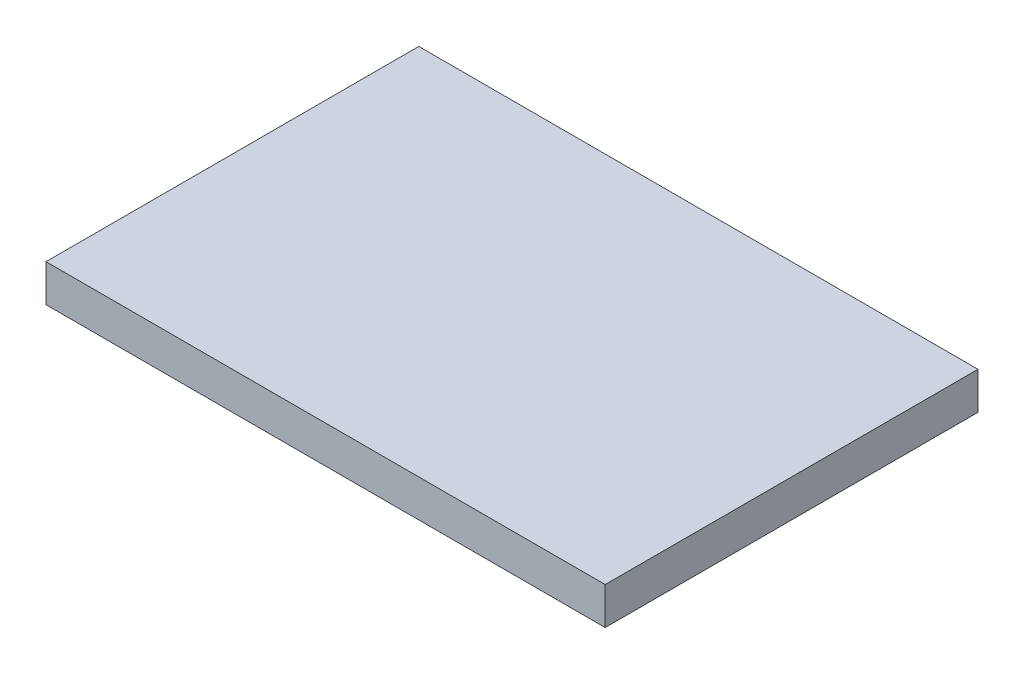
from build123d import *

# Parameters (mm, degrees)
SKETCH1_W      = 75
SKETCH1_H      = 50
EXTRUDE1_DEPTH = 5


with BuildPart() as part:
    # Sketch1 → Extrude1 (new body)
    with BuildSketch(Plane(origin=(0, 0, 0), x_dir=(1, 0, 0), z_dir=(0, 1, 0))):
        Rectangle(SKETCH1_W, SKETCH1_H)
    extrude(amount=EXTRUDE1_DEPTH)


solid = part.part
